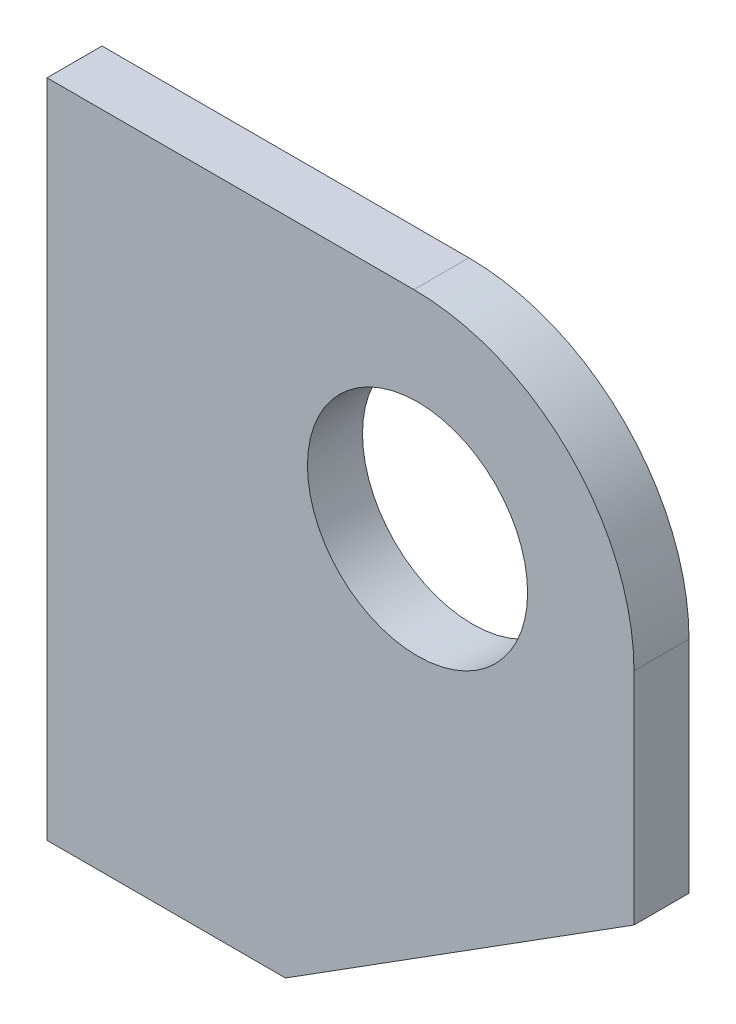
from build123d import *

# Parameters (mm, degrees)
SKETCH1_R           = 30
BOSS_EXTRUDE1_DEPTH = 15
FILLET1_R           = 60


with BuildPart() as part:
    # Sketch1 → Boss-Extrude1 (new body)
    with BuildSketch(Plane.XY):
        Polygon((0, 0), (0, 180), (160, 180), (160, 60), (65, 0), align=None)
        with Locations((101, 124)):
            Circle(SKETCH1_R, mode=Mode.SUBTRACT)
    extrude(amount=BOSS_EXTRUDE1_DEPTH)

    # Fillet1
    fillet1_edges = [part.edges().sort_by_distance(p)[0] for p in [
        (160, 180, 7.5),
    ]]
    fillet(fillet1_edges, radius=FILLET1_R)


solid = part.part
